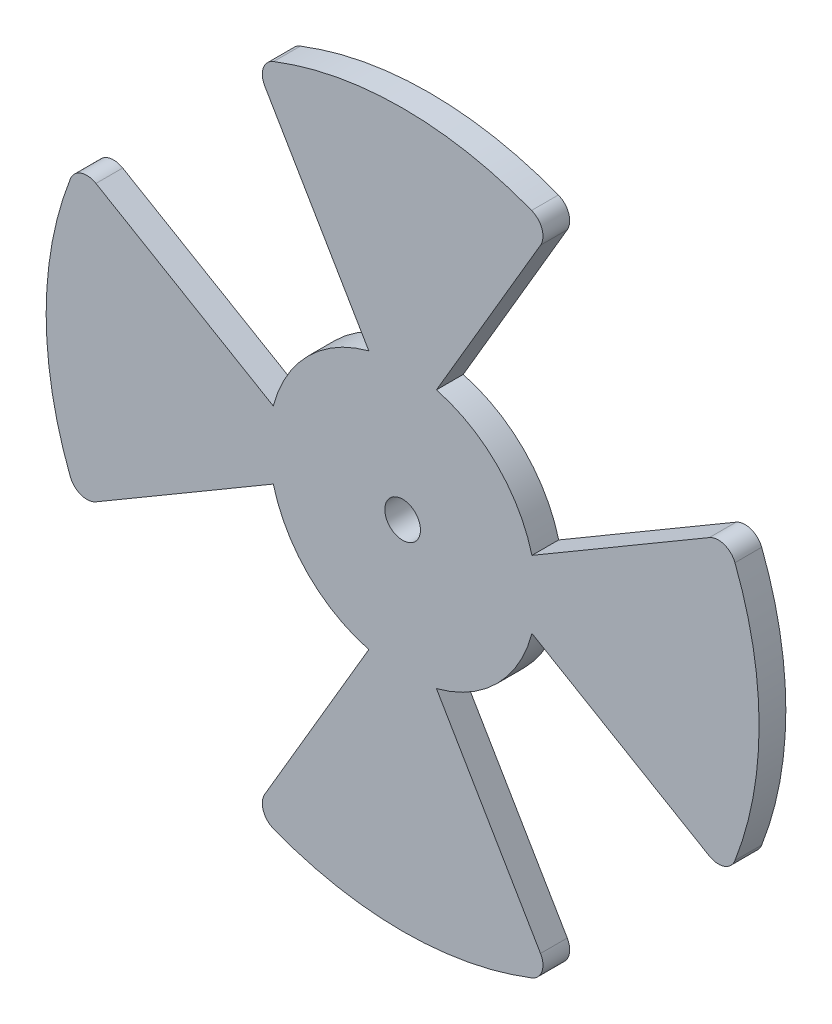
ISO-10303-21;
HEADER;
FILE_DESCRIPTION(('STEP AP214'),'2;1');
FILE_NAME('part.step','',(''),(''),'','','');
FILE_SCHEMA(('AUTOMOTIVE_DESIGN { 1 0 10303 214 1 1 1 1 }'));
ENDSEC;
DATA;
#1=APPLICATION_CONTEXT('core data for automotive mechanical design processes');
#2=APPLICATION_PROTOCOL_DEFINITION('international standard','automotive_design',2000,#1);
#3=PRODUCT_CONTEXT('',#1,'mechanical');
#4=PRODUCT('Part','Part','',(#3));
#5=PRODUCT_RELATED_PRODUCT_CATEGORY('part','',(#4));
#6=PRODUCT_DEFINITION_FORMATION('','',#4);
#7=PRODUCT_DEFINITION_CONTEXT('part definition',#1,'design');
#8=PRODUCT_DEFINITION('design','',#6,#7);
#9=PRODUCT_DEFINITION_SHAPE('','',#8);
#10=(LENGTH_UNIT() NAMED_UNIT(*) SI_UNIT(.MILLI.,.METRE.));
#11=(NAMED_UNIT(*) PLANE_ANGLE_UNIT() SI_UNIT($,.RADIAN.));
#12=(NAMED_UNIT(*) SI_UNIT($,.STERADIAN.) SOLID_ANGLE_UNIT());
#13=UNCERTAINTY_MEASURE_WITH_UNIT(LENGTH_MEASURE(1.E-05),#10,'distance_accuracy_value','');
#14=(GEOMETRIC_REPRESENTATION_CONTEXT(3) GLOBAL_UNCERTAINTY_ASSIGNED_CONTEXT((#13)) GLOBAL_UNIT_ASSIGNED_CONTEXT((#10,
#11,#12)) REPRESENTATION_CONTEXT('',''));
#15=CARTESIAN_POINT('',(0.,0.,0.));
#16=DIRECTION('',(0.,0.,1.));
#17=DIRECTION('',(1.,0.,0.));
#18=AXIS2_PLACEMENT_3D('',#15,#16,#17);
#19=CARTESIAN_POINT('',(13.7472953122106,35.4261467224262,3.));
#20=DIRECTION('',(0.,0.,1.));
#21=DIRECTION('',(1.,0.,0.));
#22=AXIS2_PLACEMENT_3D('',#19,#20,#21);
#23=PLANE('',#22);
#24=CARTESIAN_POINT('',(13.7472953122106,35.4261467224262,3.));
#25=DIRECTION('',(0.,0.,1.));
#26=DIRECTION('',(1.,0.,0.));
#27=AXIS2_PLACEMENT_3D('',#24,#25,#26);
#28=CIRCLE('',#27,2.);
#29=CARTESIAN_POINT('',(15.4722179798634,34.4139008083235,3.));
#30=VERTEX_POINT('',#29);
#31=CARTESIAN_POINT('',(14.470837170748,37.2906807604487,3.));
#32=VERTEX_POINT('',#31);
#33=EDGE_CURVE('E271',#30,#32,#28,.T.);
#34=ORIENTED_EDGE('',*,*,#33,.T.);
#35=CARTESIAN_POINT('',(0.,0.,3.));
#36=DIRECTION('',(0.,0.,1.));
#37=DIRECTION('',(1.,0.,0.));
#38=AXIS2_PLACEMENT_3D('',#35,#36,#37);
#39=CIRCLE('',#38,40.);
#40=CARTESIAN_POINT('',(-14.470837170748,37.2906807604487,3.));
#41=VERTEX_POINT('',#40);
#42=EDGE_CURVE('E139',#32,#41,#39,.T.);
#43=ORIENTED_EDGE('',*,*,#42,.T.);
#44=CARTESIAN_POINT('',(-13.7472953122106,35.4261467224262,3.));
#45=DIRECTION('',(0.,0.,1.));
#46=DIRECTION('',(1.,0.,0.));
#47=AXIS2_PLACEMENT_3D('',#44,#45,#46);
#48=CIRCLE('',#47,2.);
#49=CARTESIAN_POINT('',(-15.4722179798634,34.4139008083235,3.));
#50=VERTEX_POINT('',#49);
#51=EDGE_CURVE('E334',#41,#50,#48,.T.);
#52=ORIENTED_EDGE('',*,*,#51,.T.);
#53=DIRECTION('',(0.506122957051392,-0.862461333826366,0.));
#54=VECTOR('',#53,1.);
#55=CARTESIAN_POINT('',(-15.4722179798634,34.4139008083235,3.));
#56=LINE('',#55,#54);
#57=CARTESIAN_POINT('',(-3.79332844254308,14.5124311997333,3.));
#58=VERTEX_POINT('',#57);
#59=EDGE_CURVE('E353',#50,#58,#56,.T.);
#60=ORIENTED_EDGE('',*,*,#59,.T.);
#61=CARTESIAN_POINT('',(0.,0.,3.));
#62=DIRECTION('',(0.,0.,1.));
#63=DIRECTION('',(1.,0.,0.));
#64=AXIS2_PLACEMENT_3D('',#61,#62,#63);
#65=CIRCLE('',#64,15.);
#66=CARTESIAN_POINT('',(-14.5124311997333,3.79332844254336,3.));
#67=VERTEX_POINT('',#66);
#68=EDGE_CURVE('E350',#58,#67,#65,.T.);
#69=ORIENTED_EDGE('',*,*,#68,.T.);
#70=DIRECTION('',(-0.862461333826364,0.506122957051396,0.));
#71=VECTOR('',#70,1.);
#72=CARTESIAN_POINT('',(-34.4139008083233,15.4722179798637,3.));
#73=LINE('',#72,#71);
#74=CARTESIAN_POINT('',(-34.4139008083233,15.4722179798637,3.));
#75=VERTEX_POINT('',#74);
#76=EDGE_CURVE('E352',#67,#75,#73,.T.);
#77=ORIENTED_EDGE('',*,*,#76,.T.);
#78=CARTESIAN_POINT('',(-35.4261467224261,13.747295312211,3.));
#79=DIRECTION('',(0.,0.,1.));
#80=DIRECTION('',(1.,0.,0.));
#81=AXIS2_PLACEMENT_3D('',#78,#79,#80);
#82=CIRCLE('',#81,2.);
#83=CARTESIAN_POINT('',(-37.2906807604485,14.4708371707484,3.));
#84=VERTEX_POINT('',#83);
#85=EDGE_CURVE('E355',#75,#84,#82,.T.);
#86=ORIENTED_EDGE('',*,*,#85,.T.);
#87=CARTESIAN_POINT('',(0.,0.,3.));
#88=DIRECTION('',(0.,0.,1.));
#89=DIRECTION('',(1.,0.,0.));
#90=AXIS2_PLACEMENT_3D('',#87,#88,#89);
#91=CIRCLE('',#90,40.);
#92=CARTESIAN_POINT('',(-37.2906807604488,-14.4708371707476,3.));
#93=VERTEX_POINT('',#92);
#94=EDGE_CURVE('E361',#84,#93,#91,.T.);
#95=ORIENTED_EDGE('',*,*,#94,.T.);
#96=CARTESIAN_POINT('',(-35.4261467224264,-13.7472953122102,3.));
#97=DIRECTION('',(0.,0.,1.));
#98=DIRECTION('',(1.,0.,0.));
#99=AXIS2_PLACEMENT_3D('',#96,#97,#98);
#100=CIRCLE('',#99,2.);
#101=CARTESIAN_POINT('',(-34.4139008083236,-15.472217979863,3.));
#102=VERTEX_POINT('',#101);
#103=EDGE_CURVE('E363',#93,#102,#100,.T.);
#104=ORIENTED_EDGE('',*,*,#103,.T.);
#105=DIRECTION('',(0.862461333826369,0.506122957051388,0.));
#106=VECTOR('',#105,1.);
#107=CARTESIAN_POINT('',(-34.4139008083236,-15.472217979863,3.));
#108=LINE('',#107,#106);
#109=CARTESIAN_POINT('',(-14.5124311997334,-3.7933284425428,3.));
#110=VERTEX_POINT('',#109);
#111=EDGE_CURVE('E365',#102,#110,#108,.T.);
#112=ORIENTED_EDGE('',*,*,#111,.T.);
#113=CARTESIAN_POINT('',(0.,0.,3.));
#114=DIRECTION('',(0.,0.,1.));
#115=DIRECTION('',(1.,0.,0.));
#116=AXIS2_PLACEMENT_3D('',#113,#114,#115);
#117=CIRCLE('',#116,15.);
#118=CARTESIAN_POINT('',(-3.79332844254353,-14.5124311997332,3.));
#119=VERTEX_POINT('',#118);
#120=EDGE_CURVE('E367',#110,#119,#117,.T.);
#121=ORIENTED_EDGE('',*,*,#120,.T.);
#122=DIRECTION('',(-0.506122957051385,-0.86246133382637,0.));
#123=VECTOR('',#122,1.);
#124=CARTESIAN_POINT('',(-15.4722179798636,-34.4139008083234,3.));
#125=LINE('',#124,#123);
#126=CARTESIAN_POINT('',(-15.4722179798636,-34.4139008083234,3.));
#127=VERTEX_POINT('',#126);
#128=EDGE_CURVE('E369',#119,#127,#125,.T.);
#129=ORIENTED_EDGE('',*,*,#128,.T.);
#130=CARTESIAN_POINT('',(-13.7472953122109,-35.4261467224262,3.));
#131=DIRECTION('',(0.,0.,1.));
#132=DIRECTION('',(1.,0.,0.));
#133=AXIS2_PLACEMENT_3D('',#130,#131,#132);
#134=CIRCLE('',#133,2.);
#135=CARTESIAN_POINT('',(-14.4708371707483,-37.2906807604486,3.));
#136=VERTEX_POINT('',#135);
#137=EDGE_CURVE('E371',#127,#136,#134,.T.);
#138=ORIENTED_EDGE('',*,*,#137,.T.);
#139=CARTESIAN_POINT('',(0.,0.,3.));
#140=DIRECTION('',(0.,0.,1.));
#141=DIRECTION('',(1.,0.,0.));
#142=AXIS2_PLACEMENT_3D('',#139,#140,#141);
#143=CIRCLE('',#142,40.);
#144=CARTESIAN_POINT('',(14.4708371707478,-37.2906807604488,3.));
#145=VERTEX_POINT('',#144);
#146=EDGE_CURVE('E373',#136,#145,#143,.T.);
#147=ORIENTED_EDGE('',*,*,#146,.T.);
#148=CARTESIAN_POINT('',(13.7472953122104,-35.4261467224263,3.));
#149=DIRECTION('',(0.,0.,1.));
#150=DIRECTION('',(1.,0.,0.));
#151=AXIS2_PLACEMENT_3D('',#148,#149,#150);
#152=CIRCLE('',#151,2.);
#153=CARTESIAN_POINT('',(15.4722179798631,-34.4139008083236,3.));
#154=VERTEX_POINT('',#153);
#155=EDGE_CURVE('E375',#145,#154,#152,.T.);
#156=ORIENTED_EDGE('',*,*,#155,.T.);
#157=DIRECTION('',(-0.506122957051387,0.862461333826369,0.));
#158=VECTOR('',#157,1.);
#159=CARTESIAN_POINT('',(15.4722179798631,-34.4139008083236,3.));
#160=LINE('',#159,#158);
#161=CARTESIAN_POINT('',(3.79332844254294,-14.5124311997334,3.));
#162=VERTEX_POINT('',#161);
#163=EDGE_CURVE('E377',#154,#162,#160,.T.);
#164=ORIENTED_EDGE('',*,*,#163,.T.);
#165=CARTESIAN_POINT('',(0.,0.,3.));
#166=DIRECTION('',(0.,0.,1.));
#167=DIRECTION('',(1.,0.,0.));
#168=AXIS2_PLACEMENT_3D('',#165,#166,#167);
#169=CIRCLE('',#168,15.);
#170=CARTESIAN_POINT('',(14.5124311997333,-3.7933284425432,3.));
#171=VERTEX_POINT('',#170);
#172=EDGE_CURVE('E379',#162,#171,#169,.T.);
#173=ORIENTED_EDGE('',*,*,#172,.T.);
#174=DIRECTION('',(0.862461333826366,-0.506122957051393,0.));
#175=VECTOR('',#174,1.);
#176=CARTESIAN_POINT('',(34.4139008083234,-15.4722179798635,3.));
#177=LINE('',#176,#175);
#178=CARTESIAN_POINT('',(34.4139008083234,-15.4722179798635,3.));
#179=VERTEX_POINT('',#178);
#180=EDGE_CURVE('E381',#171,#179,#177,.T.);
#181=ORIENTED_EDGE('',*,*,#180,.T.);
#182=CARTESIAN_POINT('',(35.4261467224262,-13.7472953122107,3.));
#183=DIRECTION('',(0.,0.,1.));
#184=DIRECTION('',(1.,0.,0.));
#185=AXIS2_PLACEMENT_3D('',#182,#183,#184);
#186=CIRCLE('',#185,2.00000000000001);
#187=CARTESIAN_POINT('',(37.2906807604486,-14.4708371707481,3.));
#188=VERTEX_POINT('',#187);
#189=EDGE_CURVE('E383',#179,#188,#186,.T.);
#190=ORIENTED_EDGE('',*,*,#189,.T.);
#191=CARTESIAN_POINT('',(0.,0.,3.));
#192=DIRECTION('',(0.,0.,1.));
#193=DIRECTION('',(1.,0.,0.));
#194=AXIS2_PLACEMENT_3D('',#191,#192,#193);
#195=CIRCLE('',#194,40.);
#196=CARTESIAN_POINT('',(37.2906807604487,14.4708371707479,3.));
#197=VERTEX_POINT('',#196);
#198=EDGE_CURVE('E385',#188,#197,#195,.T.);
#199=ORIENTED_EDGE('',*,*,#198,.T.);
#200=CARTESIAN_POINT('',(35.4261467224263,13.7472953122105,3.));
#201=DIRECTION('',(0.,0.,1.));
#202=DIRECTION('',(1.,0.,0.));
#203=AXIS2_PLACEMENT_3D('',#200,#201,#202);
#204=CIRCLE('',#203,2.);
#205=CARTESIAN_POINT('',(34.4139008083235,15.4722179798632,3.));
#206=VERTEX_POINT('',#205);
#207=EDGE_CURVE('E206',#197,#206,#204,.T.);
#208=ORIENTED_EDGE('',*,*,#207,.T.);
#209=DIRECTION('',(-0.862461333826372,-0.506122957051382,0.));
#210=VECTOR('',#209,1.);
#211=CARTESIAN_POINT('',(34.4139008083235,15.4722179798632,3.));
#212=LINE('',#211,#210);
#213=CARTESIAN_POINT('',(14.5124311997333,3.79332844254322,3.));
#214=VERTEX_POINT('',#213);
#215=EDGE_CURVE('E200',#206,#214,#212,.T.);
#216=ORIENTED_EDGE('',*,*,#215,.T.);
#217=CARTESIAN_POINT('',(0.,0.,3.));
#218=DIRECTION('',(0.,0.,1.));
#219=DIRECTION('',(1.,0.,0.));
#220=AXIS2_PLACEMENT_3D('',#217,#218,#219);
#221=CIRCLE('',#220,15.);
#222=CARTESIAN_POINT('',(3.7933284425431,14.5124311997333,3.));
#223=VERTEX_POINT('',#222);
#224=EDGE_CURVE('E204',#214,#223,#221,.T.);
#225=ORIENTED_EDGE('',*,*,#224,.T.);
#226=DIRECTION('',(0.506122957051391,0.862461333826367,0.));
#227=VECTOR('',#226,1.);
#228=CARTESIAN_POINT('',(15.4722179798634,34.4139008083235,3.));
#229=LINE('',#228,#227);
#230=EDGE_CURVE('E48',#223,#30,#229,.T.);
#231=ORIENTED_EDGE('',*,*,#230,.T.);
#232=EDGE_LOOP('',(#34,#43,#52,#60,#69,#77,#86,#95,#104,#112,#121,#129,#138,#147,#156,#164,#173,
#181,#190,#199,#208,#216,#225,#231));
#233=FACE_BOUND('',#232,.T.);
#234=CARTESIAN_POINT('',(0.,0.,3.));
#235=DIRECTION('',(0.,0.,1.));
#236=DIRECTION('',(1.,0.,0.));
#237=AXIS2_PLACEMENT_3D('',#234,#235,#236);
#238=CIRCLE('',#237,2.);
#239=CARTESIAN_POINT('',(2.,0.,3.));
#240=VERTEX_POINT('',#239);
#241=EDGE_CURVE('E228',#240,#240,#238,.T.);
#242=ORIENTED_EDGE('',*,*,#241,.F.);
#243=EDGE_LOOP('',(#242));
#244=FACE_BOUND('',#243,.T.);
#245=ADVANCED_FACE('F31',(#233,#244),#23,.T.);
#246=CARTESIAN_POINT('',(13.7472953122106,35.4261467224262,0.));
#247=DIRECTION('',(0.,0.,1.));
#248=DIRECTION('',(1.,0.,0.));
#249=AXIS2_PLACEMENT_3D('',#246,#247,#248);
#250=PLANE('',#249);
#251=CARTESIAN_POINT('',(13.7472953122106,35.4261467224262,0.));
#252=DIRECTION('',(0.,0.,1.));
#253=DIRECTION('',(1.,0.,0.));
#254=AXIS2_PLACEMENT_3D('',#251,#252,#253);
#255=CIRCLE('',#254,2.);
#256=CARTESIAN_POINT('',(15.4722179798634,34.4139008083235,0.));
#257=VERTEX_POINT('',#256);
#258=CARTESIAN_POINT('',(14.470837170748,37.2906807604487,0.));
#259=VERTEX_POINT('',#258);
#260=EDGE_CURVE('E224',#257,#259,#255,.T.);
#261=ORIENTED_EDGE('',*,*,#260,.F.);
#262=DIRECTION('',(0.506122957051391,0.862461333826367,0.));
#263=VECTOR('',#262,1.);
#264=CARTESIAN_POINT('',(15.4722179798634,34.4139008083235,0.));
#265=LINE('',#264,#263);
#266=CARTESIAN_POINT('',(3.7933284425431,14.5124311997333,0.));
#267=VERTEX_POINT('',#266);
#268=EDGE_CURVE('E131',#267,#257,#265,.T.);
#269=ORIENTED_EDGE('',*,*,#268,.F.);
#270=CARTESIAN_POINT('',(0.,0.,0.));
#271=DIRECTION('',(0.,0.,1.));
#272=DIRECTION('',(1.,0.,0.));
#273=AXIS2_PLACEMENT_3D('',#270,#271,#272);
#274=CIRCLE('',#273,15.);
#275=CARTESIAN_POINT('',(14.5124311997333,3.79332844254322,0.));
#276=VERTEX_POINT('',#275);
#277=EDGE_CURVE('E125',#276,#267,#274,.T.);
#278=ORIENTED_EDGE('',*,*,#277,.F.);
#279=DIRECTION('',(-0.862461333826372,-0.506122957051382,0.));
#280=VECTOR('',#279,1.);
#281=CARTESIAN_POINT('',(34.4139008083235,15.4722179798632,0.));
#282=LINE('',#281,#280);
#283=CARTESIAN_POINT('',(34.4139008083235,15.4722179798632,0.));
#284=VERTEX_POINT('',#283);
#285=EDGE_CURVE('E214',#284,#276,#282,.T.);
#286=ORIENTED_EDGE('',*,*,#285,.F.);
#287=CARTESIAN_POINT('',(35.4261467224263,13.7472953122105,0.));
#288=DIRECTION('',(0.,0.,1.));
#289=DIRECTION('',(1.,0.,0.));
#290=AXIS2_PLACEMENT_3D('',#287,#288,#289);
#291=CIRCLE('',#290,2.);
#292=CARTESIAN_POINT('',(37.2906807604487,14.4708371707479,0.));
#293=VERTEX_POINT('',#292);
#294=EDGE_CURVE('E266',#293,#284,#291,.T.);
#295=ORIENTED_EDGE('',*,*,#294,.F.);
#296=CARTESIAN_POINT('',(0.,0.,0.));
#297=DIRECTION('',(0.,0.,1.));
#298=DIRECTION('',(1.,0.,0.));
#299=AXIS2_PLACEMENT_3D('',#296,#297,#298);
#300=CIRCLE('',#299,40.);
#301=CARTESIAN_POINT('',(37.2906807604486,-14.4708371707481,0.));
#302=VERTEX_POINT('',#301);
#303=EDGE_CURVE('E264',#302,#293,#300,.T.);
#304=ORIENTED_EDGE('',*,*,#303,.F.);
#305=CARTESIAN_POINT('',(35.4261467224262,-13.7472953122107,0.));
#306=DIRECTION('',(0.,0.,1.));
#307=DIRECTION('',(1.,0.,0.));
#308=AXIS2_PLACEMENT_3D('',#305,#306,#307);
#309=CIRCLE('',#308,2.00000000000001);
#310=CARTESIAN_POINT('',(34.4139008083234,-15.4722179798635,0.));
#311=VERTEX_POINT('',#310);
#312=EDGE_CURVE('E262',#311,#302,#309,.T.);
#313=ORIENTED_EDGE('',*,*,#312,.F.);
#314=DIRECTION('',(0.862461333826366,-0.506122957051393,0.));
#315=VECTOR('',#314,1.);
#316=CARTESIAN_POINT('',(34.4139008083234,-15.4722179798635,0.));
#317=LINE('',#316,#315);
#318=CARTESIAN_POINT('',(14.5124311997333,-3.7933284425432,0.));
#319=VERTEX_POINT('',#318);
#320=EDGE_CURVE('E260',#319,#311,#317,.T.);
#321=ORIENTED_EDGE('',*,*,#320,.F.);
#322=CARTESIAN_POINT('',(0.,0.,0.));
#323=DIRECTION('',(0.,0.,1.));
#324=DIRECTION('',(1.,0.,0.));
#325=AXIS2_PLACEMENT_3D('',#322,#323,#324);
#326=CIRCLE('',#325,15.);
#327=CARTESIAN_POINT('',(3.79332844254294,-14.5124311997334,0.));
#328=VERTEX_POINT('',#327);
#329=EDGE_CURVE('E258',#328,#319,#326,.T.);
#330=ORIENTED_EDGE('',*,*,#329,.F.);
#331=DIRECTION('',(-0.506122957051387,0.862461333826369,0.));
#332=VECTOR('',#331,1.);
#333=CARTESIAN_POINT('',(15.4722179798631,-34.4139008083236,0.));
#334=LINE('',#333,#332);
#335=CARTESIAN_POINT('',(15.4722179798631,-34.4139008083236,0.));
#336=VERTEX_POINT('',#335);
#337=EDGE_CURVE('E256',#336,#328,#334,.T.);
#338=ORIENTED_EDGE('',*,*,#337,.F.);
#339=CARTESIAN_POINT('',(13.7472953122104,-35.4261467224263,0.));
#340=DIRECTION('',(0.,0.,1.));
#341=DIRECTION('',(1.,0.,0.));
#342=AXIS2_PLACEMENT_3D('',#339,#340,#341);
#343=CIRCLE('',#342,2.);
#344=CARTESIAN_POINT('',(14.4708371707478,-37.2906807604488,0.));
#345=VERTEX_POINT('',#344);
#346=EDGE_CURVE('E254',#345,#336,#343,.T.);
#347=ORIENTED_EDGE('',*,*,#346,.F.);
#348=CARTESIAN_POINT('',(0.,0.,0.));
#349=DIRECTION('',(0.,0.,1.));
#350=DIRECTION('',(1.,0.,0.));
#351=AXIS2_PLACEMENT_3D('',#348,#349,#350);
#352=CIRCLE('',#351,40.);
#353=CARTESIAN_POINT('',(-14.4708371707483,-37.2906807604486,0.));
#354=VERTEX_POINT('',#353);
#355=EDGE_CURVE('E252',#354,#345,#352,.T.);
#356=ORIENTED_EDGE('',*,*,#355,.F.);
#357=CARTESIAN_POINT('',(-13.7472953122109,-35.4261467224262,0.));
#358=DIRECTION('',(0.,0.,1.));
#359=DIRECTION('',(1.,0.,0.));
#360=AXIS2_PLACEMENT_3D('',#357,#358,#359);
#361=CIRCLE('',#360,2.);
#362=CARTESIAN_POINT('',(-15.4722179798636,-34.4139008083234,0.));
#363=VERTEX_POINT('',#362);
#364=EDGE_CURVE('E250',#363,#354,#361,.T.);
#365=ORIENTED_EDGE('',*,*,#364,.F.);
#366=DIRECTION('',(-0.506122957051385,-0.86246133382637,0.));
#367=VECTOR('',#366,1.);
#368=CARTESIAN_POINT('',(-15.4722179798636,-34.4139008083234,0.));
#369=LINE('',#368,#367);
#370=CARTESIAN_POINT('',(-3.79332844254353,-14.5124311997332,0.));
#371=VERTEX_POINT('',#370);
#372=EDGE_CURVE('E248',#371,#363,#369,.T.);
#373=ORIENTED_EDGE('',*,*,#372,.F.);
#374=CARTESIAN_POINT('',(0.,0.,0.));
#375=DIRECTION('',(0.,0.,1.));
#376=DIRECTION('',(1.,0.,0.));
#377=AXIS2_PLACEMENT_3D('',#374,#375,#376);
#378=CIRCLE('',#377,15.);
#379=CARTESIAN_POINT('',(-14.5124311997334,-3.7933284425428,0.));
#380=VERTEX_POINT('',#379);
#381=EDGE_CURVE('E246',#380,#371,#378,.T.);
#382=ORIENTED_EDGE('',*,*,#381,.F.);
#383=DIRECTION('',(0.862461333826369,0.506122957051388,0.));
#384=VECTOR('',#383,1.);
#385=CARTESIAN_POINT('',(-34.4139008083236,-15.472217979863,0.));
#386=LINE('',#385,#384);
#387=CARTESIAN_POINT('',(-34.4139008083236,-15.472217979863,0.));
#388=VERTEX_POINT('',#387);
#389=EDGE_CURVE('E244',#388,#380,#386,.T.);
#390=ORIENTED_EDGE('',*,*,#389,.F.);
#391=CARTESIAN_POINT('',(-35.4261467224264,-13.7472953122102,0.));
#392=DIRECTION('',(0.,0.,1.));
#393=DIRECTION('',(1.,0.,0.));
#394=AXIS2_PLACEMENT_3D('',#391,#392,#393);
#395=CIRCLE('',#394,2.);
#396=CARTESIAN_POINT('',(-37.2906807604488,-14.4708371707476,0.));
#397=VERTEX_POINT('',#396);
#398=EDGE_CURVE('E242',#397,#388,#395,.T.);
#399=ORIENTED_EDGE('',*,*,#398,.F.);
#400=CARTESIAN_POINT('',(0.,0.,0.));
#401=DIRECTION('',(0.,0.,1.));
#402=DIRECTION('',(1.,0.,0.));
#403=AXIS2_PLACEMENT_3D('',#400,#401,#402);
#404=CIRCLE('',#403,40.);
#405=CARTESIAN_POINT('',(-37.2906807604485,14.4708371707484,0.));
#406=VERTEX_POINT('',#405);
#407=EDGE_CURVE('E240',#406,#397,#404,.T.);
#408=ORIENTED_EDGE('',*,*,#407,.F.);
#409=CARTESIAN_POINT('',(-35.4261467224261,13.747295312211,0.));
#410=DIRECTION('',(0.,0.,1.));
#411=DIRECTION('',(1.,0.,0.));
#412=AXIS2_PLACEMENT_3D('',#409,#410,#411);
#413=CIRCLE('',#412,2.);
#414=CARTESIAN_POINT('',(-34.4139008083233,15.4722179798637,0.));
#415=VERTEX_POINT('',#414);
#416=EDGE_CURVE('E238',#415,#406,#413,.T.);
#417=ORIENTED_EDGE('',*,*,#416,.F.);
#418=DIRECTION('',(-0.862461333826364,0.506122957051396,0.));
#419=VECTOR('',#418,1.);
#420=CARTESIAN_POINT('',(-34.4139008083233,15.4722179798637,0.));
#421=LINE('',#420,#419);
#422=CARTESIAN_POINT('',(-14.5124311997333,3.79332844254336,0.));
#423=VERTEX_POINT('',#422);
#424=EDGE_CURVE('E236',#423,#415,#421,.T.);
#425=ORIENTED_EDGE('',*,*,#424,.F.);
#426=CARTESIAN_POINT('',(0.,0.,0.));
#427=DIRECTION('',(0.,0.,1.));
#428=DIRECTION('',(1.,0.,0.));
#429=AXIS2_PLACEMENT_3D('',#426,#427,#428);
#430=CIRCLE('',#429,15.);
#431=CARTESIAN_POINT('',(-3.79332844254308,14.5124311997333,0.));
#432=VERTEX_POINT('',#431);
#433=EDGE_CURVE('E234',#432,#423,#430,.T.);
#434=ORIENTED_EDGE('',*,*,#433,.F.);
#435=DIRECTION('',(0.506122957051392,-0.862461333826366,0.));
#436=VECTOR('',#435,1.);
#437=CARTESIAN_POINT('',(-15.4722179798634,34.4139008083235,0.));
#438=LINE('',#437,#436);
#439=CARTESIAN_POINT('',(-15.4722179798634,34.4139008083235,0.));
#440=VERTEX_POINT('',#439);
#441=EDGE_CURVE('E232',#440,#432,#438,.T.);
#442=ORIENTED_EDGE('',*,*,#441,.F.);
#443=CARTESIAN_POINT('',(-13.7472953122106,35.4261467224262,0.));
#444=DIRECTION('',(0.,0.,1.));
#445=DIRECTION('',(1.,0.,0.));
#446=AXIS2_PLACEMENT_3D('',#443,#444,#445);
#447=CIRCLE('',#446,2.);
#448=CARTESIAN_POINT('',(-14.470837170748,37.2906807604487,0.));
#449=VERTEX_POINT('',#448);
#450=EDGE_CURVE('E230',#449,#440,#447,.T.);
#451=ORIENTED_EDGE('',*,*,#450,.F.);
#452=CARTESIAN_POINT('',(0.,0.,0.));
#453=DIRECTION('',(0.,0.,1.));
#454=DIRECTION('',(1.,0.,0.));
#455=AXIS2_PLACEMENT_3D('',#452,#453,#454);
#456=CIRCLE('',#455,40.);
#457=EDGE_CURVE('E227',#259,#449,#456,.T.);
#458=ORIENTED_EDGE('',*,*,#457,.F.);
#459=EDGE_LOOP('',(#261,#269,#278,#286,#295,#304,#313,#321,#330,#338,#347,#356,#365,#373,#382,
#390,#399,#408,#417,#425,#434,#442,#451,#458));
#460=FACE_BOUND('',#459,.T.);
#461=CARTESIAN_POINT('',(0.,0.,0.));
#462=DIRECTION('',(0.,0.,1.));
#463=DIRECTION('',(1.,0.,0.));
#464=AXIS2_PLACEMENT_3D('',#461,#462,#463);
#465=CIRCLE('',#464,2.);
#466=CARTESIAN_POINT('',(2.,0.,0.));
#467=VERTEX_POINT('',#466);
#468=EDGE_CURVE('E688',#467,#467,#465,.T.);
#469=ORIENTED_EDGE('',*,*,#468,.T.);
#470=EDGE_LOOP('',(#469));
#471=FACE_BOUND('',#470,.T.);
#472=ADVANCED_FACE('F338',(#460,#471),#250,.F.);
#473=CARTESIAN_POINT('',(13.7472953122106,35.4261467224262,3.));
#474=DIRECTION('',(0.,0.,-1.));
#475=DIRECTION('',(-1.,0.,0.));
#476=AXIS2_PLACEMENT_3D('',#473,#474,#475);
#477=CYLINDRICAL_SURFACE('',#476,2.);
#478=ORIENTED_EDGE('',*,*,#260,.T.);
#479=DIRECTION('',(0.,0.,-1.));
#480=VECTOR('',#479,1.);
#481=CARTESIAN_POINT('',(14.470837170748,37.2906807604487,3.));
#482=LINE('',#481,#480);
#483=EDGE_CURVE('E11',#32,#259,#482,.T.);
#484=ORIENTED_EDGE('',*,*,#483,.F.);
#485=ORIENTED_EDGE('',*,*,#33,.F.);
#486=DIRECTION('',(0.,0.,-1.));
#487=VECTOR('',#486,1.);
#488=CARTESIAN_POINT('',(15.4722179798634,34.4139008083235,3.));
#489=LINE('',#488,#487);
#490=EDGE_CURVE('E220',#30,#257,#489,.T.);
#491=ORIENTED_EDGE('',*,*,#490,.T.);
#492=EDGE_LOOP('',(#478,#484,#485,#491));
#493=FACE_BOUND('',#492,.T.);
#494=ADVANCED_FACE('F33',(#493),#477,.T.);
#495=CARTESIAN_POINT('',(0.,0.,3.));
#496=DIRECTION('',(0.,0.,-1.));
#497=DIRECTION('',(-1.,0.,0.));
#498=AXIS2_PLACEMENT_3D('',#495,#496,#497);
#499=CYLINDRICAL_SURFACE('',#498,40.);
#500=ORIENTED_EDGE('',*,*,#457,.T.);
#501=DIRECTION('',(0.,0.,-1.));
#502=VECTOR('',#501,1.);
#503=CARTESIAN_POINT('',(-14.470837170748,37.2906807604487,3.));
#504=LINE('',#503,#502);
#505=EDGE_CURVE('E40',#41,#449,#504,.T.);
#506=ORIENTED_EDGE('',*,*,#505,.F.);
#507=ORIENTED_EDGE('',*,*,#42,.F.);
#508=ORIENTED_EDGE('',*,*,#483,.T.);
#509=EDGE_LOOP('',(#500,#506,#507,#508));
#510=FACE_BOUND('',#509,.T.);
#511=ADVANCED_FACE('F419',(#510),#499,.T.);
#512=CARTESIAN_POINT('',(-13.7472953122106,35.4261467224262,3.));
#513=DIRECTION('',(0.,0.,-1.));
#514=DIRECTION('',(-1.,0.,0.));
#515=AXIS2_PLACEMENT_3D('',#512,#513,#514);
#516=CYLINDRICAL_SURFACE('',#515,2.);
#517=ORIENTED_EDGE('',*,*,#450,.T.);
#518=DIRECTION('',(0.,0.,-1.));
#519=VECTOR('',#518,1.);
#520=CARTESIAN_POINT('',(-15.4722179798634,34.4139008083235,3.));
#521=LINE('',#520,#519);
#522=EDGE_CURVE('E326',#50,#440,#521,.T.);
#523=ORIENTED_EDGE('',*,*,#522,.F.);
#524=ORIENTED_EDGE('',*,*,#51,.F.);
#525=ORIENTED_EDGE('',*,*,#505,.T.);
#526=EDGE_LOOP('',(#517,#523,#524,#525));
#527=FACE_BOUND('',#526,.T.);
#528=ADVANCED_FACE('F332',(#527),#516,.T.);
#529=CARTESIAN_POINT('',(-15.4722179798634,34.4139008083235,3.));
#530=DIRECTION('',(0.862461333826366,0.506122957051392,0.));
#531=DIRECTION('',(-0.506122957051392,0.862461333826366,0.));
#532=AXIS2_PLACEMENT_3D('',#529,#530,#531);
#533=PLANE('',#532);
#534=ORIENTED_EDGE('',*,*,#441,.T.);
#535=DIRECTION('',(0.,0.,-1.));
#536=VECTOR('',#535,1.);
#537=CARTESIAN_POINT('',(-3.79332844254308,14.5124311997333,3.));
#538=LINE('',#537,#536);
#539=EDGE_CURVE('E323',#58,#432,#538,.T.);
#540=ORIENTED_EDGE('',*,*,#539,.F.);
#541=ORIENTED_EDGE('',*,*,#59,.F.);
#542=ORIENTED_EDGE('',*,*,#522,.T.);
#543=EDGE_LOOP('',(#534,#540,#541,#542));
#544=FACE_BOUND('',#543,.T.);
#545=ADVANCED_FACE('F344',(#544),#533,.F.);
#546=CARTESIAN_POINT('',(0.,0.,3.));
#547=DIRECTION('',(0.,0.,-1.));
#548=DIRECTION('',(-1.,0.,0.));
#549=AXIS2_PLACEMENT_3D('',#546,#547,#548);
#550=CYLINDRICAL_SURFACE('',#549,15.);
#551=ORIENTED_EDGE('',*,*,#433,.T.);
#552=DIRECTION('',(0.,0.,-1.));
#553=VECTOR('',#552,1.);
#554=CARTESIAN_POINT('',(-14.5124311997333,3.79332844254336,3.));
#555=LINE('',#554,#553);
#556=EDGE_CURVE('E320',#67,#423,#555,.T.);
#557=ORIENTED_EDGE('',*,*,#556,.F.);
#558=ORIENTED_EDGE('',*,*,#68,.F.);
#559=ORIENTED_EDGE('',*,*,#539,.T.);
#560=EDGE_LOOP('',(#551,#557,#558,#559));
#561=FACE_BOUND('',#560,.T.);
#562=ADVANCED_FACE('F348',(#561),#550,.T.);
#563=CARTESIAN_POINT('',(-34.4139008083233,15.4722179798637,3.));
#564=DIRECTION('',(-0.506122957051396,-0.862461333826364,0.));
#565=DIRECTION('',(0.862461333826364,-0.506122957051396,0.));
#566=AXIS2_PLACEMENT_3D('',#563,#564,#565);
#567=PLANE('',#566);
#568=ORIENTED_EDGE('',*,*,#424,.T.);
#569=DIRECTION('',(0.,0.,-1.));
#570=VECTOR('',#569,1.);
#571=CARTESIAN_POINT('',(-34.4139008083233,15.4722179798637,3.));
#572=LINE('',#571,#570);
#573=EDGE_CURVE('E317',#75,#415,#572,.T.);
#574=ORIENTED_EDGE('',*,*,#573,.F.);
#575=ORIENTED_EDGE('',*,*,#76,.F.);
#576=ORIENTED_EDGE('',*,*,#556,.T.);
#577=EDGE_LOOP('',(#568,#574,#575,#576));
#578=FACE_BOUND('',#577,.T.);
#579=ADVANCED_FACE('F432',(#578),#567,.F.);
#580=CARTESIAN_POINT('',(-35.4261467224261,13.747295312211,3.));
#581=DIRECTION('',(0.,0.,-1.));
#582=DIRECTION('',(-1.,0.,0.));
#583=AXIS2_PLACEMENT_3D('',#580,#581,#582);
#584=CYLINDRICAL_SURFACE('',#583,2.);
#585=ORIENTED_EDGE('',*,*,#416,.T.);
#586=DIRECTION('',(0.,0.,-1.));
#587=VECTOR('',#586,1.);
#588=CARTESIAN_POINT('',(-37.2906807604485,14.4708371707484,3.));
#589=LINE('',#588,#587);
#590=EDGE_CURVE('E314',#84,#406,#589,.T.);
#591=ORIENTED_EDGE('',*,*,#590,.F.);
#592=ORIENTED_EDGE('',*,*,#85,.F.);
#593=ORIENTED_EDGE('',*,*,#573,.T.);
#594=EDGE_LOOP('',(#585,#591,#592,#593));
#595=FACE_BOUND('',#594,.T.);
#596=ADVANCED_FACE('F435',(#595),#584,.T.);
#597=CARTESIAN_POINT('',(0.,0.,3.));
#598=DIRECTION('',(0.,0.,-1.));
#599=DIRECTION('',(-1.,0.,0.));
#600=AXIS2_PLACEMENT_3D('',#597,#598,#599);
#601=CYLINDRICAL_SURFACE('',#600,40.);
#602=ORIENTED_EDGE('',*,*,#407,.T.);
#603=DIRECTION('',(0.,0.,-1.));
#604=VECTOR('',#603,1.);
#605=CARTESIAN_POINT('',(-37.2906807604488,-14.4708371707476,3.));
#606=LINE('',#605,#604);
#607=EDGE_CURVE('E311',#93,#397,#606,.T.);
#608=ORIENTED_EDGE('',*,*,#607,.F.);
#609=ORIENTED_EDGE('',*,*,#94,.F.);
#610=ORIENTED_EDGE('',*,*,#590,.T.);
#611=EDGE_LOOP('',(#602,#608,#609,#610));
#612=FACE_BOUND('',#611,.T.);
#613=ADVANCED_FACE('F439',(#612),#601,.T.);
#614=CARTESIAN_POINT('',(-35.4261467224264,-13.7472953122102,3.));
#615=DIRECTION('',(0.,0.,-1.));
#616=DIRECTION('',(-1.,0.,0.));
#617=AXIS2_PLACEMENT_3D('',#614,#615,#616);
#618=CYLINDRICAL_SURFACE('',#617,2.);
#619=ORIENTED_EDGE('',*,*,#398,.T.);
#620=DIRECTION('',(0.,0.,-1.));
#621=VECTOR('',#620,1.);
#622=CARTESIAN_POINT('',(-34.4139008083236,-15.472217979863,3.));
#623=LINE('',#622,#621);
#624=EDGE_CURVE('E308',#102,#388,#623,.T.);
#625=ORIENTED_EDGE('',*,*,#624,.F.);
#626=ORIENTED_EDGE('',*,*,#103,.F.);
#627=ORIENTED_EDGE('',*,*,#607,.T.);
#628=EDGE_LOOP('',(#619,#625,#626,#627));
#629=FACE_BOUND('',#628,.T.);
#630=ADVANCED_FACE('F443',(#629),#618,.T.);
#631=CARTESIAN_POINT('',(-34.4139008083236,-15.472217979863,3.));
#632=DIRECTION('',(-0.506122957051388,0.862461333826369,0.));
#633=DIRECTION('',(-0.862461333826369,-0.506122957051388,0.));
#634=AXIS2_PLACEMENT_3D('',#631,#632,#633);
#635=PLANE('',#634);
#636=ORIENTED_EDGE('',*,*,#389,.T.);
#637=DIRECTION('',(0.,0.,-1.));
#638=VECTOR('',#637,1.);
#639=CARTESIAN_POINT('',(-14.5124311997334,-3.7933284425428,3.));
#640=LINE('',#639,#638);
#641=EDGE_CURVE('E305',#110,#380,#640,.T.);
#642=ORIENTED_EDGE('',*,*,#641,.F.);
#643=ORIENTED_EDGE('',*,*,#111,.F.);
#644=ORIENTED_EDGE('',*,*,#624,.T.);
#645=EDGE_LOOP('',(#636,#642,#643,#644));
#646=FACE_BOUND('',#645,.T.);
#647=ADVANCED_FACE('F447',(#646),#635,.F.);
#648=CARTESIAN_POINT('',(0.,0.,3.));
#649=DIRECTION('',(0.,0.,-1.));
#650=DIRECTION('',(-1.,0.,0.));
#651=AXIS2_PLACEMENT_3D('',#648,#649,#650);
#652=CYLINDRICAL_SURFACE('',#651,15.);
#653=ORIENTED_EDGE('',*,*,#381,.T.);
#654=DIRECTION('',(0.,0.,-1.));
#655=VECTOR('',#654,1.);
#656=CARTESIAN_POINT('',(-3.79332844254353,-14.5124311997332,3.));
#657=LINE('',#656,#655);
#658=EDGE_CURVE('E302',#119,#371,#657,.T.);
#659=ORIENTED_EDGE('',*,*,#658,.F.);
#660=ORIENTED_EDGE('',*,*,#120,.F.);
#661=ORIENTED_EDGE('',*,*,#641,.T.);
#662=EDGE_LOOP('',(#653,#659,#660,#661));
#663=FACE_BOUND('',#662,.T.);
#664=ADVANCED_FACE('F451',(#663),#652,.T.);
#665=CARTESIAN_POINT('',(-15.4722179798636,-34.4139008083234,3.));
#666=DIRECTION('',(0.86246133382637,-0.506122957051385,0.));
#667=DIRECTION('',(0.506122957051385,0.86246133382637,0.));
#668=AXIS2_PLACEMENT_3D('',#665,#666,#667);
#669=PLANE('',#668);
#670=ORIENTED_EDGE('',*,*,#372,.T.);
#671=DIRECTION('',(0.,0.,-1.));
#672=VECTOR('',#671,1.);
#673=CARTESIAN_POINT('',(-15.4722179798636,-34.4139008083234,3.));
#674=LINE('',#673,#672);
#675=EDGE_CURVE('E299',#127,#363,#674,.T.);
#676=ORIENTED_EDGE('',*,*,#675,.F.);
#677=ORIENTED_EDGE('',*,*,#128,.F.);
#678=ORIENTED_EDGE('',*,*,#658,.T.);
#679=EDGE_LOOP('',(#670,#676,#677,#678));
#680=FACE_BOUND('',#679,.T.);
#681=ADVANCED_FACE('F455',(#680),#669,.F.);
#682=CARTESIAN_POINT('',(-13.7472953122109,-35.4261467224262,3.));
#683=DIRECTION('',(0.,0.,-1.));
#684=DIRECTION('',(-1.,0.,0.));
#685=AXIS2_PLACEMENT_3D('',#682,#683,#684);
#686=CYLINDRICAL_SURFACE('',#685,2.);
#687=ORIENTED_EDGE('',*,*,#364,.T.);
#688=DIRECTION('',(0.,0.,-1.));
#689=VECTOR('',#688,1.);
#690=CARTESIAN_POINT('',(-14.4708371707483,-37.2906807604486,3.));
#691=LINE('',#690,#689);
#692=EDGE_CURVE('E296',#136,#354,#691,.T.);
#693=ORIENTED_EDGE('',*,*,#692,.F.);
#694=ORIENTED_EDGE('',*,*,#137,.F.);
#695=ORIENTED_EDGE('',*,*,#675,.T.);
#696=EDGE_LOOP('',(#687,#693,#694,#695));
#697=FACE_BOUND('',#696,.T.);
#698=ADVANCED_FACE('F459',(#697),#686,.T.);
#699=CARTESIAN_POINT('',(0.,0.,3.));
#700=DIRECTION('',(0.,0.,-1.));
#701=DIRECTION('',(-1.,0.,0.));
#702=AXIS2_PLACEMENT_3D('',#699,#700,#701);
#703=CYLINDRICAL_SURFACE('',#702,40.);
#704=ORIENTED_EDGE('',*,*,#355,.T.);
#705=DIRECTION('',(0.,0.,-1.));
#706=VECTOR('',#705,1.);
#707=CARTESIAN_POINT('',(14.4708371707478,-37.2906807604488,3.));
#708=LINE('',#707,#706);
#709=EDGE_CURVE('E293',#145,#345,#708,.T.);
#710=ORIENTED_EDGE('',*,*,#709,.F.);
#711=ORIENTED_EDGE('',*,*,#146,.F.);
#712=ORIENTED_EDGE('',*,*,#692,.T.);
#713=EDGE_LOOP('',(#704,#710,#711,#712));
#714=FACE_BOUND('',#713,.T.);
#715=ADVANCED_FACE('F463',(#714),#703,.T.);
#716=CARTESIAN_POINT('',(13.7472953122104,-35.4261467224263,3.));
#717=DIRECTION('',(0.,0.,-1.));
#718=DIRECTION('',(-1.,0.,0.));
#719=AXIS2_PLACEMENT_3D('',#716,#717,#718);
#720=CYLINDRICAL_SURFACE('',#719,2.);
#721=ORIENTED_EDGE('',*,*,#346,.T.);
#722=DIRECTION('',(0.,0.,-1.));
#723=VECTOR('',#722,1.);
#724=CARTESIAN_POINT('',(15.4722179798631,-34.4139008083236,3.));
#725=LINE('',#724,#723);
#726=EDGE_CURVE('E290',#154,#336,#725,.T.);
#727=ORIENTED_EDGE('',*,*,#726,.F.);
#728=ORIENTED_EDGE('',*,*,#155,.F.);
#729=ORIENTED_EDGE('',*,*,#709,.T.);
#730=EDGE_LOOP('',(#721,#727,#728,#729));
#731=FACE_BOUND('',#730,.T.);
#732=ADVANCED_FACE('F467',(#731),#720,.T.);
#733=CARTESIAN_POINT('',(15.4722179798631,-34.4139008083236,3.));
#734=DIRECTION('',(-0.862461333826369,-0.506122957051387,0.));
#735=DIRECTION('',(0.506122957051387,-0.862461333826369,0.));
#736=AXIS2_PLACEMENT_3D('',#733,#734,#735);
#737=PLANE('',#736);
#738=ORIENTED_EDGE('',*,*,#337,.T.);
#739=DIRECTION('',(0.,0.,-1.));
#740=VECTOR('',#739,1.);
#741=CARTESIAN_POINT('',(3.79332844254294,-14.5124311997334,3.));
#742=LINE('',#741,#740);
#743=EDGE_CURVE('E287',#162,#328,#742,.T.);
#744=ORIENTED_EDGE('',*,*,#743,.F.);
#745=ORIENTED_EDGE('',*,*,#163,.F.);
#746=ORIENTED_EDGE('',*,*,#726,.T.);
#747=EDGE_LOOP('',(#738,#744,#745,#746));
#748=FACE_BOUND('',#747,.T.);
#749=ADVANCED_FACE('F471',(#748),#737,.F.);
#750=CARTESIAN_POINT('',(0.,0.,3.));
#751=DIRECTION('',(0.,0.,-1.));
#752=DIRECTION('',(-1.,0.,0.));
#753=AXIS2_PLACEMENT_3D('',#750,#751,#752);
#754=CYLINDRICAL_SURFACE('',#753,15.);
#755=ORIENTED_EDGE('',*,*,#329,.T.);
#756=DIRECTION('',(0.,0.,-1.));
#757=VECTOR('',#756,1.);
#758=CARTESIAN_POINT('',(14.5124311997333,-3.7933284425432,3.));
#759=LINE('',#758,#757);
#760=EDGE_CURVE('E284',#171,#319,#759,.T.);
#761=ORIENTED_EDGE('',*,*,#760,.F.);
#762=ORIENTED_EDGE('',*,*,#172,.F.);
#763=ORIENTED_EDGE('',*,*,#743,.T.);
#764=EDGE_LOOP('',(#755,#761,#762,#763));
#765=FACE_BOUND('',#764,.T.);
#766=ADVANCED_FACE('F475',(#765),#754,.T.);
#767=CARTESIAN_POINT('',(34.4139008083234,-15.4722179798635,3.));
#768=DIRECTION('',(0.506122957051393,0.862461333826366,0.));
#769=DIRECTION('',(-0.862461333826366,0.506122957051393,0.));
#770=AXIS2_PLACEMENT_3D('',#767,#768,#769);
#771=PLANE('',#770);
#772=ORIENTED_EDGE('',*,*,#320,.T.);
#773=DIRECTION('',(0.,0.,-1.));
#774=VECTOR('',#773,1.);
#775=CARTESIAN_POINT('',(34.4139008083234,-15.4722179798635,3.));
#776=LINE('',#775,#774);
#777=EDGE_CURVE('E281',#179,#311,#776,.T.);
#778=ORIENTED_EDGE('',*,*,#777,.F.);
#779=ORIENTED_EDGE('',*,*,#180,.F.);
#780=ORIENTED_EDGE('',*,*,#760,.T.);
#781=EDGE_LOOP('',(#772,#778,#779,#780));
#782=FACE_BOUND('',#781,.T.);
#783=ADVANCED_FACE('F479',(#782),#771,.F.);
#784=CARTESIAN_POINT('',(35.4261467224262,-13.7472953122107,3.));
#785=DIRECTION('',(0.,0.,-1.));
#786=DIRECTION('',(-1.,0.,0.));
#787=AXIS2_PLACEMENT_3D('',#784,#785,#786);
#788=CYLINDRICAL_SURFACE('',#787,2.00000000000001);
#789=ORIENTED_EDGE('',*,*,#312,.T.);
#790=DIRECTION('',(0.,0.,-1.));
#791=VECTOR('',#790,1.);
#792=CARTESIAN_POINT('',(37.2906807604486,-14.4708371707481,3.));
#793=LINE('',#792,#791);
#794=EDGE_CURVE('E278',#188,#302,#793,.T.);
#795=ORIENTED_EDGE('',*,*,#794,.F.);
#796=ORIENTED_EDGE('',*,*,#189,.F.);
#797=ORIENTED_EDGE('',*,*,#777,.T.);
#798=EDGE_LOOP('',(#789,#795,#796,#797));
#799=FACE_BOUND('',#798,.T.);
#800=ADVANCED_FACE('F483',(#799),#788,.T.);
#801=CARTESIAN_POINT('',(0.,0.,3.));
#802=DIRECTION('',(0.,0.,-1.));
#803=DIRECTION('',(-1.,0.,0.));
#804=AXIS2_PLACEMENT_3D('',#801,#802,#803);
#805=CYLINDRICAL_SURFACE('',#804,40.);
#806=ORIENTED_EDGE('',*,*,#303,.T.);
#807=DIRECTION('',(0.,0.,-1.));
#808=VECTOR('',#807,1.);
#809=CARTESIAN_POINT('',(37.2906807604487,14.4708371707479,3.));
#810=LINE('',#809,#808);
#811=EDGE_CURVE('E275',#197,#293,#810,.T.);
#812=ORIENTED_EDGE('',*,*,#811,.F.);
#813=ORIENTED_EDGE('',*,*,#198,.F.);
#814=ORIENTED_EDGE('',*,*,#794,.T.);
#815=EDGE_LOOP('',(#806,#812,#813,#814));
#816=FACE_BOUND('',#815,.T.);
#817=ADVANCED_FACE('F391',(#816),#805,.T.);
#818=CARTESIAN_POINT('',(35.4261467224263,13.7472953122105,3.));
#819=DIRECTION('',(0.,0.,-1.));
#820=DIRECTION('',(-1.,0.,0.));
#821=AXIS2_PLACEMENT_3D('',#818,#819,#820);
#822=CYLINDRICAL_SURFACE('',#821,2.);
#823=ORIENTED_EDGE('',*,*,#294,.T.);
#824=DIRECTION('',(0.,0.,-1.));
#825=VECTOR('',#824,1.);
#826=CARTESIAN_POINT('',(34.4139008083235,15.4722179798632,3.));
#827=LINE('',#826,#825);
#828=EDGE_CURVE('E215',#206,#284,#827,.T.);
#829=ORIENTED_EDGE('',*,*,#828,.F.);
#830=ORIENTED_EDGE('',*,*,#207,.F.);
#831=ORIENTED_EDGE('',*,*,#811,.T.);
#832=EDGE_LOOP('',(#823,#829,#830,#831));
#833=FACE_BOUND('',#832,.T.);
#834=ADVANCED_FACE('F395',(#833),#822,.T.);
#835=CARTESIAN_POINT('',(34.4139008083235,15.4722179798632,3.));
#836=DIRECTION('',(0.506122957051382,-0.862461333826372,0.));
#837=DIRECTION('',(0.862461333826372,0.506122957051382,0.));
#838=AXIS2_PLACEMENT_3D('',#835,#836,#837);
#839=PLANE('',#838);
#840=ORIENTED_EDGE('',*,*,#285,.T.);
#841=DIRECTION('',(0.,0.,-1.));
#842=VECTOR('',#841,1.);
#843=CARTESIAN_POINT('',(14.5124311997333,3.79332844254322,3.));
#844=LINE('',#843,#842);
#845=EDGE_CURVE('E211',#214,#276,#844,.T.);
#846=ORIENTED_EDGE('',*,*,#845,.F.);
#847=ORIENTED_EDGE('',*,*,#215,.F.);
#848=ORIENTED_EDGE('',*,*,#828,.T.);
#849=EDGE_LOOP('',(#840,#846,#847,#848));
#850=FACE_BOUND('',#849,.T.);
#851=ADVANCED_FACE('F212',(#850),#839,.F.);
#852=CARTESIAN_POINT('',(0.,0.,3.));
#853=DIRECTION('',(0.,0.,-1.));
#854=DIRECTION('',(-1.,0.,0.));
#855=AXIS2_PLACEMENT_3D('',#852,#853,#854);
#856=CYLINDRICAL_SURFACE('',#855,15.);
#857=ORIENTED_EDGE('',*,*,#277,.T.);
#858=DIRECTION('',(0.,0.,-1.));
#859=VECTOR('',#858,1.);
#860=CARTESIAN_POINT('',(3.7933284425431,14.5124311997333,3.));
#861=LINE('',#860,#859);
#862=EDGE_CURVE('E216',#223,#267,#861,.T.);
#863=ORIENTED_EDGE('',*,*,#862,.F.);
#864=ORIENTED_EDGE('',*,*,#224,.F.);
#865=ORIENTED_EDGE('',*,*,#845,.T.);
#866=EDGE_LOOP('',(#857,#863,#864,#865));
#867=FACE_BOUND('',#866,.T.);
#868=ADVANCED_FACE('F218',(#867),#856,.T.);
#869=CARTESIAN_POINT('',(15.4722179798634,34.4139008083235,3.));
#870=DIRECTION('',(-0.862461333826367,0.506122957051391,0.));
#871=DIRECTION('',(-0.506122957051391,-0.862461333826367,0.));
#872=AXIS2_PLACEMENT_3D('',#869,#870,#871);
#873=PLANE('',#872);
#874=ORIENTED_EDGE('',*,*,#268,.T.);
#875=ORIENTED_EDGE('',*,*,#490,.F.);
#876=ORIENTED_EDGE('',*,*,#230,.F.);
#877=ORIENTED_EDGE('',*,*,#862,.T.);
#878=EDGE_LOOP('',(#874,#875,#876,#877));
#879=FACE_BOUND('',#878,.T.);
#880=ADVANCED_FACE('F399',(#879),#873,.F.);
#881=CARTESIAN_POINT('',(0.,0.,3.));
#882=DIRECTION('',(0.,0.,-1.));
#883=DIRECTION('',(-1.,0.,0.));
#884=AXIS2_PLACEMENT_3D('',#881,#882,#883);
#885=CYLINDRICAL_SURFACE('',#884,2.);
#886=ORIENTED_EDGE('',*,*,#241,.T.);
#887=EDGE_LOOP('',(#886));
#888=FACE_BOUND('',#887,.T.);
#889=ORIENTED_EDGE('',*,*,#468,.F.);
#890=EDGE_LOOP('',(#889));
#891=FACE_BOUND('',#890,.T.);
#892=ADVANCED_FACE('F401',(#888,#891),#885,.F.);
#893=CLOSED_SHELL('',(#245,#472,#494,#511,#528,#545,#562,#579,#596,#613,#630,#647,#664,#681,
#698,#715,#732,#749,#766,#783,#800,#817,#834,#851,#868,#880,#892));
#894=MANIFOLD_SOLID_BREP('B2',#893);
#895=ADVANCED_BREP_SHAPE_REPRESENTATION('',(#18,#894),#14);
#896=SHAPE_DEFINITION_REPRESENTATION(#9,#895);
ENDSEC;
END-ISO-10303-21;
